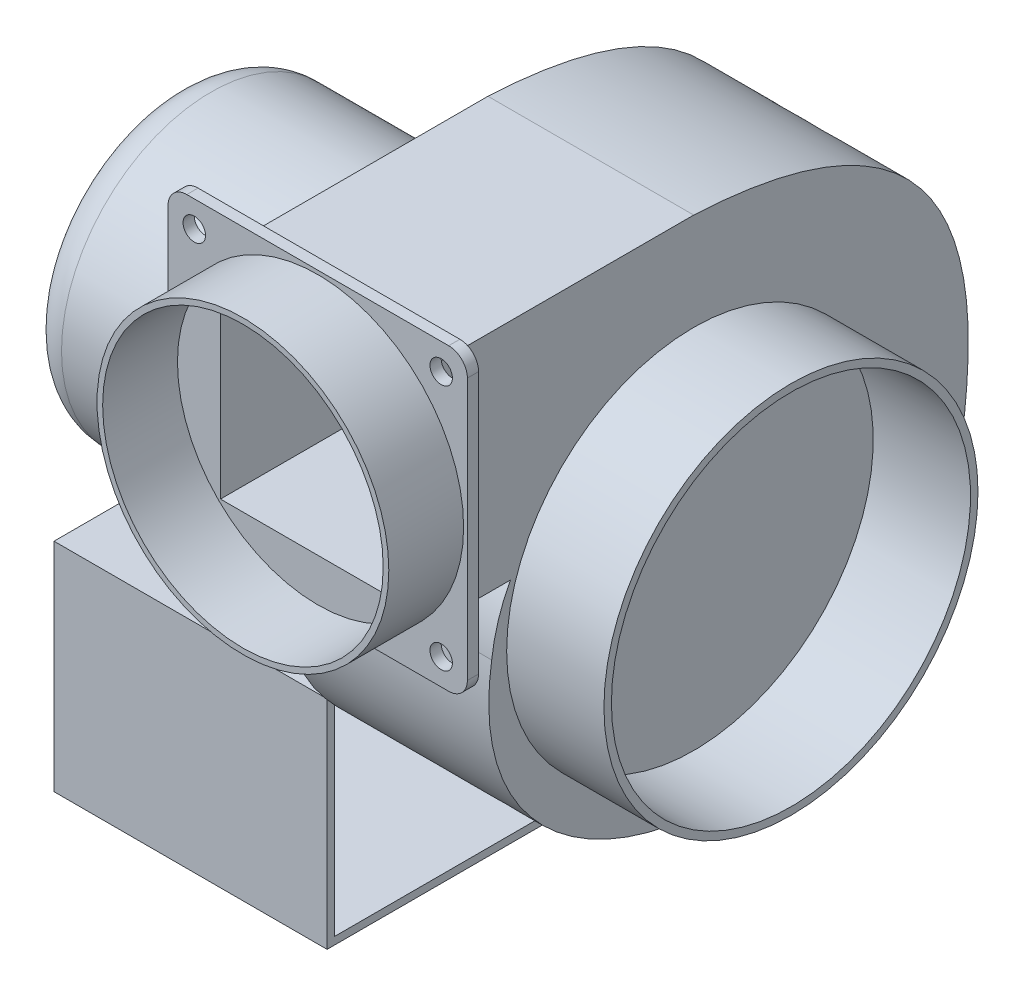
from build123d import *

# Parameters (mm, degrees)
EXTRUDE_1_DEPTH     = 55
EXTRUDE_2_DEPTH     = 3
SKETCH_3_R          = 3
CUT_EXTRUDE_1_DEPTH = 3
SKETCH_4_W          = 52
SKETCH_4_H          = 52
CUT_EXTRUDE_2_DEPTH = 70
SKETCH_5_R          = 39
SKETCH_5_R_2        = 37.5
EXTRUDE_3_DEPTH     = 20
SKETCH_6_R          = 50
SKETCH_6_R_2        = 48
EXTRUDE_4_DEPTH     = 26
SKETCH_8_R          = 40
EXTRUDE_5_DEPTH     = 84
FILLET_1_R          = 10
SKETCH_11_W         = 86
SKETCH_11_H         = 58
SKETCH_11_W_2       = 82
SKETCH_11_H_2       = 54
EXTRUDE_6_DEPTH     = 73
SKETCH_12_R         = 3
CUT_EXTRUDE_3_DEPTH = 2


with BuildPart() as part:
    # Sketch 1 → Extrude 1 (new body)
    with BuildSketch(Plane(origin=(0, 0, 0), x_dir=(0, 0, -1), z_dir=(1, 0, 0))):
        with BuildLine():
            Line((0, 76), (-70, 76))
            Line((-70, 76), (-70, 16))
            Line((-70, 16), (-49, 16))
            add(Edge.make_bspline(
                [(-54, 0), (-53.035983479, 8.454554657), (-49, 16)],
                knots=[0, 0, 0, 1, 1, 1], degree=2))
            add(Edge.make_bspline(
                [(-54, 0), (-66.125283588, -77.158464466), (67.422373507, -91.404587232), (73, 0)],
                knots=[0, 0, 0, 0, 1, 1, 1, 1], degree=3))
            add(Edge.make_bspline(
                [(73, 0), (78.959235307, 72.282321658), (0, 76)],
                knots=[0, 0, 0, 1, 1, 1], degree=2))
        make_face()
    extrude(amount=EXTRUDE_1_DEPTH)

    # Sketch 2 → Extrude 2 (add)
    with BuildSketch(Plane.XY.offset(70)):
        with BuildLine():
            Line((-7.5, 6), (62.5, 6))
            ThreePointArc((62.5, 6), (66.035533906, 7.464466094), (67.5, 11))
            Line((67.5, 11), (67.5, 81))
            ThreePointArc((67.5, 81), (66.035533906, 84.535533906), (62.5, 86))
            Line((62.5, 86), (-7.5, 86))
            ThreePointArc((-7.5, 86), (-11.035533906, 84.535533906), (-12.5, 81))
            Line((-12.5, 81), (-12.5, 11))
            ThreePointArc((-12.5, 11), (-11.035533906, 7.464466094), (-7.5, 6))
        make_face()
    extrude(amount=EXTRUDE_2_DEPTH)

    # Sketch 3 → Cut-Extrude 1 (cut)
    with BuildSketch(Plane.XY.offset(73)):
        with Locations((-5.5, 79)):
            Circle(SKETCH_3_R)
        with Locations((60.5, 79)):
            Circle(SKETCH_3_R)
        with Locations((60.5, 13)):
            Circle(SKETCH_3_R)
        with Locations((-5.5, 13)):
            Circle(SKETCH_3_R)
    extrude(amount=-CUT_EXTRUDE_1_DEPTH, mode=Mode.SUBTRACT)

    # Sketch 4 → Cut-Extrude 2 (cut)
    with BuildSketch(Plane.XY.offset(73)):
        with Locations((27.5, 46)):
            Rectangle(SKETCH_4_W, SKETCH_4_H)
    extrude(amount=-CUT_EXTRUDE_2_DEPTH, mode=Mode.SUBTRACT)

    # Sketch 8 → Extrude 5 (add)
    with BuildSketch(Plane.ZY):
        with Locations(Location((0, 0, 0), (0, 0, 180))):
            Circle(SKETCH_8_R)
    extrude(amount=EXTRUDE_5_DEPTH)

    # Fillet 1
    fillet_1_edges = [part.edges().sort_by_distance(p)[0] for p in [
        (-84, 0, 40),
    ]]
    fillet(fillet_1_edges, radius=FILLET_1_R)


with BuildPart() as body_2:
    # Sketch 5 → Extrude 3 (new body)
    with BuildSketch(Plane.XY.offset(73)):
        with Locations((27.5, 46)):
            Circle(SKETCH_5_R)
        with Locations((27.5, 46)):
            Circle(SKETCH_5_R_2, mode=Mode.SUBTRACT)
    extrude(amount=EXTRUDE_3_DEPTH)


with BuildPart() as body_3:
    # Sketch 6 → Extrude 4 (new body)
    with BuildSketch(Plane(origin=(55, 0, 0), x_dir=(0, 0, -1), z_dir=(1, 0, 0))):
        with Locations(Location((0, 0, 0), (0, 0, 180))):
            Circle(SKETCH_6_R)
        with Locations(Location((0, 0, 0), (0, 0, 180))):
            Circle(SKETCH_6_R_2, mode=Mode.SUBTRACT)
    extrude(amount=EXTRUDE_4_DEPTH)


with BuildPart() as body_4:
    # Sketch 11 → Extrude 6 (new body)
    with BuildSketch(Plane.ZY):
        with Locations((0, -71)):
            Rectangle(SKETCH_11_W, SKETCH_11_H)
        with Locations((0, -71)):
            Rectangle(SKETCH_11_W_2, SKETCH_11_H_2, mode=Mode.SUBTRACT)
    extrude(amount=EXTRUDE_6_DEPTH)

    # Sketch 12 → Cut-Extrude 3 (cut)
    with BuildSketch(Plane.XZ.offset(100)):
        with Locations(Location((-53, 27.5, 0), (0, 0, 270))):
            Circle(SKETCH_12_R)
        with Locations(Location((-20, 27.5, 0), (0, 0, 270))):
            Circle(SKETCH_12_R)
        with Locations(Location((-20, -27.5, 0), (0, 0, 270))):
            Circle(SKETCH_12_R)
        with Locations(Location((-53, -27.5, 0), (0, 0, 270))):
            Circle(SKETCH_12_R)
    extrude(amount=-CUT_EXTRUDE_3_DEPTH, mode=Mode.SUBTRACT)


solid = Compound([part.part, body_2.part, body_3.part, body_4.part])
